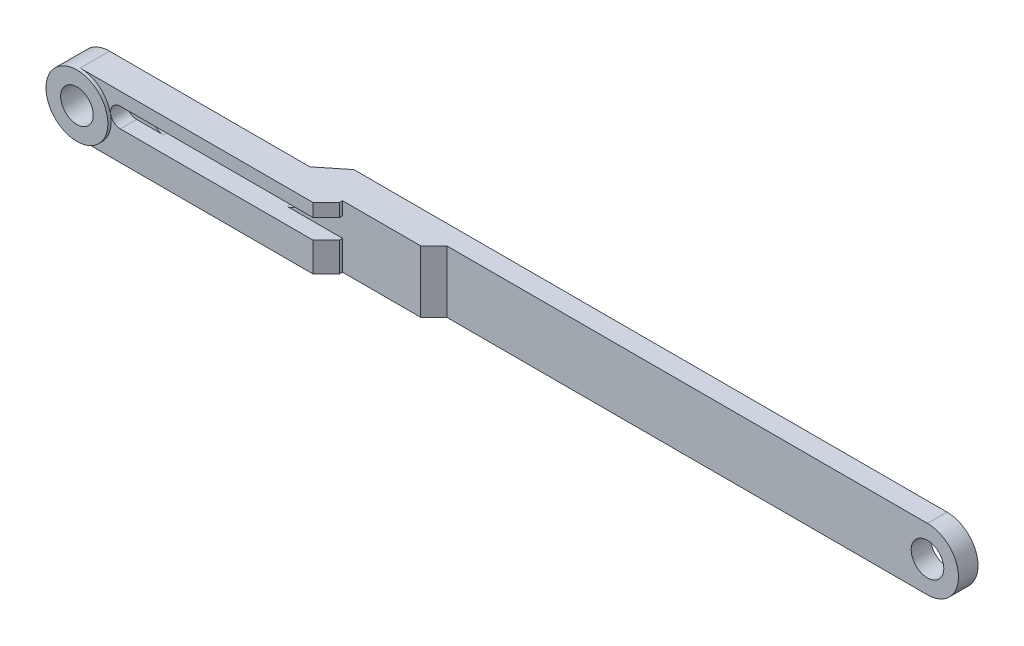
ISO-10303-21;
HEADER;
FILE_DESCRIPTION(('STEP AP214'),'2;1');
FILE_NAME('part.step','',(''),(''),'','','');
FILE_SCHEMA(('AUTOMOTIVE_DESIGN { 1 0 10303 214 1 1 1 1 }'));
ENDSEC;
DATA;
#1=APPLICATION_CONTEXT('core data for automotive mechanical design processes');
#2=APPLICATION_PROTOCOL_DEFINITION('international standard','automotive_design',2000,#1);
#3=PRODUCT_CONTEXT('',#1,'mechanical');
#4=PRODUCT('Part','Part','',(#3));
#5=PRODUCT_RELATED_PRODUCT_CATEGORY('part','',(#4));
#6=PRODUCT_DEFINITION_FORMATION('','',#4);
#7=PRODUCT_DEFINITION_CONTEXT('part definition',#1,'design');
#8=PRODUCT_DEFINITION('design','',#6,#7);
#9=PRODUCT_DEFINITION_SHAPE('','',#8);
#10=(LENGTH_UNIT() NAMED_UNIT(*) SI_UNIT(.MILLI.,.METRE.));
#11=(NAMED_UNIT(*) PLANE_ANGLE_UNIT() SI_UNIT($,.RADIAN.));
#12=(NAMED_UNIT(*) SI_UNIT($,.STERADIAN.) SOLID_ANGLE_UNIT());
#13=UNCERTAINTY_MEASURE_WITH_UNIT(LENGTH_MEASURE(1.E-05),#10,'distance_accuracy_value','');
#14=(GEOMETRIC_REPRESENTATION_CONTEXT(3) GLOBAL_UNCERTAINTY_ASSIGNED_CONTEXT((#13)) GLOBAL_UNIT_ASSIGNED_CONTEXT((#10,
#11,#12)) REPRESENTATION_CONTEXT('',''));
#15=CARTESIAN_POINT('',(0.,0.,0.));
#16=DIRECTION('',(0.,0.,1.));
#17=DIRECTION('',(1.,0.,0.));
#18=AXIS2_PLACEMENT_3D('',#15,#16,#17);
#19=CARTESIAN_POINT('',(42.5,9.49999999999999,4.5));
#20=DIRECTION('',(1.,0.,0.));
#21=DIRECTION('',(0.,0.,-1.));
#22=AXIS2_PLACEMENT_3D('',#19,#20,#21);
#23=PLANE('',#22);
#24=DIRECTION('',(0.,0.,1.));
#25=VECTOR('',#24,1.);
#26=CARTESIAN_POINT('',(42.5,4.49999999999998,2.));
#27=LINE('',#26,#25);
#28=CARTESIAN_POINT('',(42.5,4.49999999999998,2.49999999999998));
#29=VERTEX_POINT('',#28);
#30=CARTESIAN_POINT('',(42.5,4.49999999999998,2.00000000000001));
#31=VERTEX_POINT('',#30);
#32=EDGE_CURVE('E272',#29,#31,#27,.F.);
#33=ORIENTED_EDGE('',*,*,#32,.F.);
#34=DIRECTION('',(0.,-1.,0.));
#35=VECTOR('',#34,1.);
#36=CARTESIAN_POINT('',(42.5,9.49999999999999,2.49999999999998));
#37=LINE('',#36,#35);
#38=CARTESIAN_POINT('',(42.5,0.,2.49999999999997));
#39=VERTEX_POINT('',#38);
#40=EDGE_CURVE('E363',#29,#39,#37,.T.);
#41=ORIENTED_EDGE('',*,*,#40,.T.);
#42=DIRECTION('',(0.,0.,-1.));
#43=VECTOR('',#42,1.);
#44=CARTESIAN_POINT('',(42.5,0.,4.5));
#45=LINE('',#44,#43);
#46=CARTESIAN_POINT('',(42.5,0.,2.));
#47=VERTEX_POINT('',#46);
#48=EDGE_CURVE('E454',#39,#47,#45,.T.);
#49=ORIENTED_EDGE('',*,*,#48,.T.);
#50=DIRECTION('',(0.,-1.,0.));
#51=VECTOR('',#50,1.);
#52=CARTESIAN_POINT('',(42.5,9.49999999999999,2.));
#53=LINE('',#52,#51);
#54=EDGE_CURVE('E227',#31,#47,#53,.T.);
#55=ORIENTED_EDGE('',*,*,#54,.F.);
#56=EDGE_LOOP('',(#33,#41,#49,#55));
#57=FACE_BOUND('',#56,.T.);
#58=ADVANCED_FACE('F51',(#57),#23,.T.);
#59=CARTESIAN_POINT('',(4.75,4.75,4.5));
#60=DIRECTION('',(0.,0.,1.));
#61=DIRECTION('',(1.,0.,0.));
#62=AXIS2_PLACEMENT_3D('',#59,#60,#61);
#63=PLANE('',#62);
#64=DIRECTION('',(1.,0.,0.));
#65=VECTOR('',#64,1.);
#66=CARTESIAN_POINT('',(15.,7.49999999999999,4.5));
#67=LINE('',#66,#65);
#68=CARTESIAN_POINT('',(10.9053629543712,7.49999999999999,4.5));
#69=VERTEX_POINT('',#68);
#70=CARTESIAN_POINT('',(40.5,7.49999999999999,4.5));
#71=VERTEX_POINT('',#70);
#72=EDGE_CURVE('E413',#69,#71,#67,.T.);
#73=ORIENTED_EDGE('',*,*,#72,.T.);
#74=DIRECTION('',(0.,1.,0.));
#75=VECTOR('',#74,1.);
#76=CARTESIAN_POINT('',(40.5,4.75,4.5));
#77=LINE('',#76,#75);
#78=CARTESIAN_POINT('',(40.5,9.49999999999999,4.5));
#79=VERTEX_POINT('',#78);
#80=EDGE_CURVE('E374',#71,#79,#77,.T.);
#81=ORIENTED_EDGE('',*,*,#80,.T.);
#82=DIRECTION('',(1.,0.,0.));
#83=VECTOR('',#82,1.);
#84=CARTESIAN_POINT('',(42.5,9.49999999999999,4.5));
#85=LINE('',#84,#83);
#86=CARTESIAN_POINT('',(4.75,9.5,4.5));
#87=VERTEX_POINT('',#86);
#88=EDGE_CURVE('E441',#87,#79,#85,.T.);
#89=ORIENTED_EDGE('',*,*,#88,.F.);
#90=CARTESIAN_POINT('',(4.75,4.75,4.5));
#91=DIRECTION('',(0.,0.,1.));
#92=DIRECTION('',(1.,0.,0.));
#93=AXIS2_PLACEMENT_3D('',#90,#91,#92);
#94=CIRCLE('',#93,4.75);
#95=CARTESIAN_POINT('',(4.75,0.,4.5));
#96=VERTEX_POINT('',#95);
#97=EDGE_CURVE('E439',#96,#87,#94,.T.);
#98=ORIENTED_EDGE('',*,*,#97,.F.);
#99=DIRECTION('',(-1.,0.,0.));
#100=VECTOR('',#99,1.);
#101=CARTESIAN_POINT('',(4.75,0.,4.5));
#102=LINE('',#101,#100);
#103=CARTESIAN_POINT('',(40.5,0.,4.5));
#104=VERTEX_POINT('',#103);
#105=EDGE_CURVE('E445',#104,#96,#102,.T.);
#106=ORIENTED_EDGE('',*,*,#105,.F.);
#107=DIRECTION('',(0.,1.,0.));
#108=VECTOR('',#107,1.);
#109=CARTESIAN_POINT('',(40.5,4.75,4.5));
#110=LINE('',#109,#108);
#111=CARTESIAN_POINT('',(40.5,4.49999999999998,4.5));
#112=VERTEX_POINT('',#111);
#113=EDGE_CURVE('E468',#104,#112,#110,.T.);
#114=ORIENTED_EDGE('',*,*,#113,.T.);
#115=DIRECTION('',(-1.,0.,0.));
#116=VECTOR('',#115,1.);
#117=CARTESIAN_POINT('',(15.,4.49999999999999,4.5));
#118=LINE('',#117,#116);
#119=CARTESIAN_POINT('',(10.9053629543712,4.49999999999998,4.5));
#120=VERTEX_POINT('',#119);
#121=EDGE_CURVE('E417',#112,#120,#118,.T.);
#122=ORIENTED_EDGE('',*,*,#121,.T.);
#123=CARTESIAN_POINT('',(10.9053629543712,5.99999999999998,4.5));
#124=DIRECTION('',(0.,0.,1.));
#125=DIRECTION('',(1.,0.,0.));
#126=AXIS2_PLACEMENT_3D('',#123,#124,#125);
#127=CIRCLE('',#126,1.5);
#128=EDGE_CURVE('E265',#120,#69,#127,.F.);
#129=ORIENTED_EDGE('',*,*,#128,.T.);
#130=EDGE_LOOP('',(#73,#81,#89,#98,#106,#114,#122,#129));
#131=FACE_BOUND('',#130,.T.);
#132=ADVANCED_FACE('F311',(#131),#63,.T.);
#133=CARTESIAN_POINT('',(15.,5.99999999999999,4.5));
#134=DIRECTION('',(0.,0.,-1.));
#135=DIRECTION('',(-1.,0.,0.));
#136=AXIS2_PLACEMENT_3D('',#133,#134,#135);
#137=CYLINDRICAL_SURFACE('',#136,1.5);
#138=CARTESIAN_POINT('',(15.,5.99999999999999,2.));
#139=DIRECTION('',(0.,0.,1.));
#140=DIRECTION('',(1.,0.,0.));
#141=AXIS2_PLACEMENT_3D('',#138,#139,#140);
#142=CIRCLE('',#141,1.5);
#143=CARTESIAN_POINT('',(15.,4.49999999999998,2.00000000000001));
#144=VERTEX_POINT('',#143);
#145=CARTESIAN_POINT('',(15.,7.49999999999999,2.));
#146=VERTEX_POINT('',#145);
#147=EDGE_CURVE('E240',#144,#146,#142,.F.);
#148=ORIENTED_EDGE('',*,*,#147,.F.);
#149=DIRECTION('',(0.,0.,-1.));
#150=VECTOR('',#149,1.);
#151=CARTESIAN_POINT('',(15.,4.49999999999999,4.5));
#152=LINE('',#151,#150);
#153=CARTESIAN_POINT('',(15.,4.49999999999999,0.));
#154=VERTEX_POINT('',#153);
#155=EDGE_CURVE('E398',#144,#154,#152,.T.);
#156=ORIENTED_EDGE('',*,*,#155,.T.);
#157=CARTESIAN_POINT('',(15.,5.99999999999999,0.));
#158=DIRECTION('',(0.,0.,-1.));
#159=DIRECTION('',(-1.,0.,0.));
#160=AXIS2_PLACEMENT_3D('',#157,#158,#159);
#161=CIRCLE('',#160,1.5);
#162=CARTESIAN_POINT('',(15.,7.49999999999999,0.));
#163=VERTEX_POINT('',#162);
#164=EDGE_CURVE('E412',#154,#163,#161,.T.);
#165=ORIENTED_EDGE('',*,*,#164,.T.);
#166=DIRECTION('',(0.,0.,-1.));
#167=VECTOR('',#166,1.);
#168=CARTESIAN_POINT('',(15.,7.49999999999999,4.5));
#169=LINE('',#168,#167);
#170=EDGE_CURVE('E437',#146,#163,#169,.T.);
#171=ORIENTED_EDGE('',*,*,#170,.F.);
#172=EDGE_LOOP('',(#148,#156,#165,#171));
#173=FACE_BOUND('',#172,.T.);
#174=ADVANCED_FACE('F304',(#173),#137,.F.);
#175=CARTESIAN_POINT('',(34.,5.99999999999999,4.5));
#176=DIRECTION('',(0.,0.,-1.));
#177=DIRECTION('',(-1.,0.,0.));
#178=AXIS2_PLACEMENT_3D('',#175,#176,#177);
#179=CYLINDRICAL_SURFACE('',#178,1.5);
#180=CARTESIAN_POINT('',(34.,5.99999999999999,2.));
#181=DIRECTION('',(0.,0.,1.));
#182=DIRECTION('',(1.,0.,0.));
#183=AXIS2_PLACEMENT_3D('',#180,#181,#182);
#184=CIRCLE('',#183,1.5);
#185=CARTESIAN_POINT('',(34.,7.49999999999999,2.));
#186=VERTEX_POINT('',#185);
#187=CARTESIAN_POINT('',(34.,4.49999999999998,2.));
#188=VERTEX_POINT('',#187);
#189=EDGE_CURVE('E206',#186,#188,#184,.F.);
#190=ORIENTED_EDGE('',*,*,#189,.F.);
#191=DIRECTION('',(0.,0.,-1.));
#192=VECTOR('',#191,1.);
#193=CARTESIAN_POINT('',(34.,7.49999999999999,4.5));
#194=LINE('',#193,#192);
#195=CARTESIAN_POINT('',(34.,7.49999999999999,0.));
#196=VERTEX_POINT('',#195);
#197=EDGE_CURVE('E213',#186,#196,#194,.T.);
#198=ORIENTED_EDGE('',*,*,#197,.T.);
#199=CARTESIAN_POINT('',(34.,5.99999999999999,0.));
#200=DIRECTION('',(0.,0.,-1.));
#201=DIRECTION('',(-1.,0.,0.));
#202=AXIS2_PLACEMENT_3D('',#199,#200,#201);
#203=CIRCLE('',#202,1.5);
#204=CARTESIAN_POINT('',(34.,4.49999999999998,0.));
#205=VERTEX_POINT('',#204);
#206=EDGE_CURVE('E424',#196,#205,#203,.T.);
#207=ORIENTED_EDGE('',*,*,#206,.T.);
#208=DIRECTION('',(0.,0.,-1.));
#209=VECTOR('',#208,1.);
#210=CARTESIAN_POINT('',(34.,4.49999999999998,4.5));
#211=LINE('',#210,#209);
#212=EDGE_CURVE('E432',#188,#205,#211,.T.);
#213=ORIENTED_EDGE('',*,*,#212,.F.);
#214=EDGE_LOOP('',(#190,#198,#207,#213));
#215=FACE_BOUND('',#214,.T.);
#216=ADVANCED_FACE('F300',(#215),#179,.F.);
#217=CARTESIAN_POINT('',(130.25,4.75,0.));
#218=DIRECTION('',(0.,0.,-1.));
#219=DIRECTION('',(-1.,0.,0.));
#220=AXIS2_PLACEMENT_3D('',#217,#218,#219);
#221=PLANE('',#220);
#222=CARTESIAN_POINT('',(130.25,4.75,0.));
#223=DIRECTION('',(0.,0.,-1.));
#224=DIRECTION('',(-1.,0.,0.));
#225=AXIS2_PLACEMENT_3D('',#222,#223,#224);
#226=CIRCLE('',#225,2.5);
#227=CARTESIAN_POINT('',(127.75,4.75,0.));
#228=VERTEX_POINT('',#227);
#229=EDGE_CURVE('E231',#228,#228,#226,.T.);
#230=ORIENTED_EDGE('',*,*,#229,.T.);
#231=EDGE_LOOP('',(#230));
#232=FACE_BOUND('',#231,.T.);
#233=DIRECTION('',(0.,1.,0.));
#234=VECTOR('',#233,1.);
#235=CARTESIAN_POINT('',(56.5,0.,0.));
#236=LINE('',#235,#234);
#237=CARTESIAN_POINT('',(56.5,0.,0.));
#238=VERTEX_POINT('',#237);
#239=CARTESIAN_POINT('',(56.5,9.49999999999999,0.));
#240=VERTEX_POINT('',#239);
#241=EDGE_CURVE('E237',#238,#240,#236,.T.);
#242=ORIENTED_EDGE('',*,*,#241,.F.);
#243=DIRECTION('',(-1.,0.,0.));
#244=VECTOR('',#243,1.);
#245=CARTESIAN_POINT('',(42.5,0.,0.));
#246=LINE('',#245,#244);
#247=CARTESIAN_POINT('',(130.25,0.,0.));
#248=VERTEX_POINT('',#247);
#249=EDGE_CURVE('E400',#248,#238,#246,.T.);
#250=ORIENTED_EDGE('',*,*,#249,.F.);
#251=CARTESIAN_POINT('',(130.25,4.75,0.));
#252=DIRECTION('',(0.,0.,-1.));
#253=DIRECTION('',(-1.,0.,0.));
#254=AXIS2_PLACEMENT_3D('',#251,#252,#253);
#255=CIRCLE('',#254,4.75);
#256=CARTESIAN_POINT('',(130.25,9.5,0.));
#257=VERTEX_POINT('',#256);
#258=EDGE_CURVE('E258',#257,#248,#255,.T.);
#259=ORIENTED_EDGE('',*,*,#258,.F.);
#260=DIRECTION('',(1.,0.,0.));
#261=VECTOR('',#260,1.);
#262=CARTESIAN_POINT('',(42.5,9.49999999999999,0.));
#263=LINE('',#262,#261);
#264=EDGE_CURVE('E244',#240,#257,#263,.T.);
#265=ORIENTED_EDGE('',*,*,#264,.F.);
#266=EDGE_LOOP('',(#242,#250,#259,#265));
#267=FACE_BOUND('',#266,.T.);
#268=ADVANCED_FACE('F303',(#232,#267),#221,.F.);
#269=CARTESIAN_POINT('',(0.,0.,0.));
#270=DIRECTION('',(0.,0.,1.));
#271=DIRECTION('',(1.,0.,0.));
#272=AXIS2_PLACEMENT_3D('',#269,#270,#271);
#273=PLANE('',#272);
#274=DIRECTION('',(1.,0.,0.));
#275=VECTOR('',#274,1.);
#276=CARTESIAN_POINT('',(15.,7.49999999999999,0.));
#277=LINE('',#276,#275);
#278=EDGE_CURVE('E421',#163,#196,#277,.T.);
#279=ORIENTED_EDGE('',*,*,#278,.F.);
#280=ORIENTED_EDGE('',*,*,#164,.F.);
#281=DIRECTION('',(-1.,0.,0.));
#282=VECTOR('',#281,1.);
#283=CARTESIAN_POINT('',(15.,4.49999999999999,0.));
#284=LINE('',#283,#282);
#285=EDGE_CURVE('E418',#205,#154,#284,.T.);
#286=ORIENTED_EDGE('',*,*,#285,.F.);
#287=ORIENTED_EDGE('',*,*,#206,.F.);
#288=EDGE_LOOP('',(#279,#280,#286,#287));
#289=FACE_BOUND('',#288,.T.);
#290=CARTESIAN_POINT('',(4.75,4.75,0.));
#291=DIRECTION('',(0.,0.,1.));
#292=DIRECTION('',(1.,0.,0.));
#293=AXIS2_PLACEMENT_3D('',#290,#291,#292);
#294=CIRCLE('',#293,2.5);
#295=CARTESIAN_POINT('',(7.25,4.75,0.));
#296=VERTEX_POINT('',#295);
#297=EDGE_CURVE('E453',#296,#296,#294,.T.);
#298=ORIENTED_EDGE('',*,*,#297,.T.);
#299=EDGE_LOOP('',(#298));
#300=FACE_BOUND('',#299,.T.);
#301=DIRECTION('',(-0.593199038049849,0.805055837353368,0.));
#302=VECTOR('',#301,1.);
#303=CARTESIAN_POINT('',(35.5,9.5,0.));
#304=LINE('',#303,#302);
#305=CARTESIAN_POINT('',(42.5,0.,0.));
#306=VERTEX_POINT('',#305);
#307=CARTESIAN_POINT('',(35.5,9.5,0.));
#308=VERTEX_POINT('',#307);
#309=EDGE_CURVE('E251',#306,#308,#304,.T.);
#310=ORIENTED_EDGE('',*,*,#309,.F.);
#311=DIRECTION('',(-1.,0.,0.));
#312=VECTOR('',#311,1.);
#313=CARTESIAN_POINT('',(4.75,0.,0.));
#314=LINE('',#313,#312);
#315=CARTESIAN_POINT('',(4.75,0.,0.));
#316=VERTEX_POINT('',#315);
#317=EDGE_CURVE('E397',#306,#316,#314,.T.);
#318=ORIENTED_EDGE('',*,*,#317,.T.);
#319=CARTESIAN_POINT('',(4.75,4.75,0.));
#320=DIRECTION('',(0.,0.,1.));
#321=DIRECTION('',(1.,0.,0.));
#322=AXIS2_PLACEMENT_3D('',#319,#320,#321);
#323=CIRCLE('',#322,4.75);
#324=CARTESIAN_POINT('',(4.75,9.5,0.));
#325=VERTEX_POINT('',#324);
#326=EDGE_CURVE('E394',#325,#316,#323,.T.);
#327=ORIENTED_EDGE('',*,*,#326,.F.);
#328=DIRECTION('',(1.,0.,0.));
#329=VECTOR('',#328,1.);
#330=CARTESIAN_POINT('',(42.5,9.49999999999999,0.));
#331=LINE('',#330,#329);
#332=EDGE_CURVE('E390',#325,#308,#331,.T.);
#333=ORIENTED_EDGE('',*,*,#332,.T.);
#334=EDGE_LOOP('',(#310,#318,#327,#333));
#335=FACE_BOUND('',#334,.T.);
#336=ADVANCED_FACE('F329',(#289,#300,#335),#273,.F.);
#337=CARTESIAN_POINT('',(4.75,4.75,5.));
#338=DIRECTION('',(0.,0.,-1.));
#339=DIRECTION('',(-1.,0.,0.));
#340=AXIS2_PLACEMENT_3D('',#337,#338,#339);
#341=CYLINDRICAL_SURFACE('',#340,4.75);
#342=CARTESIAN_POINT('',(4.75,4.75,5.));
#343=DIRECTION('',(0.,0.,1.));
#344=DIRECTION('',(1.,0.,0.));
#345=AXIS2_PLACEMENT_3D('',#342,#343,#344);
#346=CIRCLE('',#345,4.75);
#347=CARTESIAN_POINT('',(9.5,4.75,5.));
#348=VERTEX_POINT('',#347);
#349=EDGE_CURVE('E269',#348,#348,#346,.T.);
#350=ORIENTED_EDGE('',*,*,#349,.F.);
#351=EDGE_LOOP('',(#350));
#352=FACE_BOUND('',#351,.T.);
#353=DIRECTION('',(0.,0.,-1.));
#354=VECTOR('',#353,1.);
#355=CARTESIAN_POINT('',(4.75,0.,4.5));
#356=LINE('',#355,#354);
#357=EDGE_CURVE('E450',#96,#316,#356,.T.);
#358=ORIENTED_EDGE('',*,*,#357,.F.);
#359=ORIENTED_EDGE('',*,*,#97,.T.);
#360=DIRECTION('',(0.,0.,-1.));
#361=VECTOR('',#360,1.);
#362=CARTESIAN_POINT('',(4.75,9.5,4.5));
#363=LINE('',#362,#361);
#364=EDGE_CURVE('E446',#87,#325,#363,.T.);
#365=ORIENTED_EDGE('',*,*,#364,.T.);
#366=ORIENTED_EDGE('',*,*,#326,.T.);
#367=EDGE_LOOP('',(#358,#359,#365,#366));
#368=FACE_BOUND('',#367,.T.);
#369=ADVANCED_FACE('F332',(#352,#368),#341,.T.);
#370=CARTESIAN_POINT('',(4.75,4.75,5.));
#371=DIRECTION('',(0.,0.,-1.));
#372=DIRECTION('',(-1.,0.,0.));
#373=AXIS2_PLACEMENT_3D('',#370,#371,#372);
#374=CYLINDRICAL_SURFACE('',#373,2.5);
#375=CARTESIAN_POINT('',(4.75,4.75,5.));
#376=DIRECTION('',(0.,0.,1.));
#377=DIRECTION('',(1.,0.,0.));
#378=AXIS2_PLACEMENT_3D('',#375,#376,#377);
#379=CIRCLE('',#378,2.5);
#380=CARTESIAN_POINT('',(7.25,4.75,5.));
#381=VERTEX_POINT('',#380);
#382=EDGE_CURVE('E458',#381,#381,#379,.T.);
#383=ORIENTED_EDGE('',*,*,#382,.T.);
#384=EDGE_LOOP('',(#383));
#385=FACE_BOUND('',#384,.T.);
#386=ORIENTED_EDGE('',*,*,#297,.F.);
#387=EDGE_LOOP('',(#386));
#388=FACE_BOUND('',#387,.T.);
#389=ADVANCED_FACE('F327',(#385,#388),#374,.F.);
#390=CARTESIAN_POINT('',(0.,0.,5.));
#391=DIRECTION('',(0.,0.,1.));
#392=DIRECTION('',(1.,0.,0.));
#393=AXIS2_PLACEMENT_3D('',#390,#391,#392);
#394=PLANE('',#393);
#395=ORIENTED_EDGE('',*,*,#382,.F.);
#396=EDGE_LOOP('',(#395));
#397=FACE_BOUND('',#396,.T.);
#398=ORIENTED_EDGE('',*,*,#349,.T.);
#399=EDGE_LOOP('',(#398));
#400=FACE_BOUND('',#399,.T.);
#401=ADVANCED_FACE('F319',(#397,#400),#394,.T.);
#402=CARTESIAN_POINT('',(4.75,0.,4.5));
#403=DIRECTION('',(0.,-1.,0.));
#404=DIRECTION('',(1.,0.,0.));
#405=AXIS2_PLACEMENT_3D('',#402,#403,#404);
#406=PLANE('',#405);
#407=ORIENTED_EDGE('',*,*,#317,.F.);
#408=DIRECTION('',(0.778944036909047,0.,-0.627093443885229));
#409=VECTOR('',#408,1.);
#410=CARTESIAN_POINT('',(17.3969254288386,0.,20.2093767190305));
#411=LINE('',#410,#409);
#412=CARTESIAN_POINT('',(46.2264495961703,0.,-3.));
#413=VERTEX_POINT('',#412);
#414=EDGE_CURVE('E13',#306,#413,#411,.T.);
#415=ORIENTED_EDGE('',*,*,#414,.T.);
#416=DIRECTION('',(-1.,0.,0.));
#417=VECTOR('',#416,1.);
#418=CARTESIAN_POINT('',(42.5,0.,-3.));
#419=LINE('',#418,#417);
#420=CARTESIAN_POINT('',(130.25,0.,-3.));
#421=VERTEX_POINT('',#420);
#422=EDGE_CURVE('E253',#421,#413,#419,.T.);
#423=ORIENTED_EDGE('',*,*,#422,.F.);
#424=DIRECTION('',(0.,0.,1.));
#425=VECTOR('',#424,1.);
#426=CARTESIAN_POINT('',(130.25,0.,-3.));
#427=LINE('',#426,#425);
#428=EDGE_CURVE('E255',#421,#248,#427,.T.);
#429=ORIENTED_EDGE('',*,*,#428,.T.);
#430=ORIENTED_EDGE('',*,*,#249,.T.);
#431=DIRECTION('',(-0.707106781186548,0.,0.707106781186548));
#432=VECTOR('',#431,1.);
#433=CARTESIAN_POINT('',(28.375,0.,28.125));
#434=LINE('',#433,#432);
#435=CARTESIAN_POINT('',(54.5,0.,2.));
#436=VERTEX_POINT('',#435);
#437=EDGE_CURVE('E477',#238,#436,#434,.T.);
#438=ORIENTED_EDGE('',*,*,#437,.T.);
#439=DIRECTION('',(1.,0.,0.));
#440=VECTOR('',#439,1.);
#441=CARTESIAN_POINT('',(42.5,0.,2.));
#442=LINE('',#441,#440);
#443=EDGE_CURVE('E226',#47,#436,#442,.T.);
#444=ORIENTED_EDGE('',*,*,#443,.F.);
#445=ORIENTED_EDGE('',*,*,#48,.F.);
#446=DIRECTION('',(0.707106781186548,0.,-0.707106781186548));
#447=VECTOR('',#446,1.);
#448=CARTESIAN_POINT('',(22.625,0.,22.375));
#449=LINE('',#448,#447);
#450=EDGE_CURVE('E369',#39,#104,#449,.F.);
#451=ORIENTED_EDGE('',*,*,#450,.T.);
#452=ORIENTED_EDGE('',*,*,#105,.T.);
#453=ORIENTED_EDGE('',*,*,#357,.T.);
#454=EDGE_LOOP('',(#407,#415,#423,#429,#430,#438,#444,#445,#451,#452,#453));
#455=FACE_BOUND('',#454,.T.);
#456=ADVANCED_FACE('F316',(#455),#406,.T.);
#457=DIRECTION('',(0.,0.,-1.));
#458=VECTOR('',#457,1.);
#459=CARTESIAN_POINT('',(42.5,9.49999999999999,4.5));
#460=LINE('',#459,#458);
#461=CARTESIAN_POINT('',(42.5,9.49999999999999,2.49999999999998));
#462=VERTEX_POINT('',#461);
#463=CARTESIAN_POINT('',(42.5,9.49999999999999,2.));
#464=VERTEX_POINT('',#463);
#465=EDGE_CURVE('E456',#462,#464,#460,.T.);
#466=ORIENTED_EDGE('',*,*,#465,.F.);
#467=DIRECTION('',(0.,-1.,0.));
#468=VECTOR('',#467,1.);
#469=CARTESIAN_POINT('',(42.5,9.49999999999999,2.49999999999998));
#470=LINE('',#469,#468);
#471=CARTESIAN_POINT('',(42.5,7.49999999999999,2.49999999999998));
#472=VERTEX_POINT('',#471);
#473=EDGE_CURVE('E204',#462,#472,#470,.T.);
#474=ORIENTED_EDGE('',*,*,#473,.T.);
#475=DIRECTION('',(0.,0.,-1.));
#476=VECTOR('',#475,1.);
#477=CARTESIAN_POINT('',(42.5,7.49999999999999,4.));
#478=LINE('',#477,#476);
#479=CARTESIAN_POINT('',(42.5,7.49999999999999,1.99999999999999));
#480=VERTEX_POINT('',#479);
#481=EDGE_CURVE('E197',#472,#480,#478,.T.);
#482=ORIENTED_EDGE('',*,*,#481,.T.);
#483=EDGE_CURVE('E202',#464,#480,#53,.T.);
#484=ORIENTED_EDGE('',*,*,#483,.F.);
#485=EDGE_LOOP('',(#466,#474,#482,#484));
#486=FACE_BOUND('',#485,.T.);
#487=ADVANCED_FACE('F200',(#486),#23,.T.);
#488=CARTESIAN_POINT('',(42.5,9.49999999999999,4.5));
#489=DIRECTION('',(0.,1.,0.));
#490=DIRECTION('',(-1.,0.,0.));
#491=AXIS2_PLACEMENT_3D('',#488,#489,#490);
#492=PLANE('',#491);
#493=DIRECTION('',(1.,0.,0.));
#494=VECTOR('',#493,1.);
#495=CARTESIAN_POINT('',(42.5,9.49999999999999,-3.));
#496=LINE('',#495,#494);
#497=CARTESIAN_POINT('',(39.2264495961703,9.49999999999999,-3.));
#498=VERTEX_POINT('',#497);
#499=CARTESIAN_POINT('',(130.25,9.5,-3.));
#500=VERTEX_POINT('',#499);
#501=EDGE_CURVE('E247',#498,#500,#496,.T.);
#502=ORIENTED_EDGE('',*,*,#501,.F.);
#503=DIRECTION('',(-0.778944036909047,0.,0.627093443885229));
#504=VECTOR('',#503,1.);
#505=CARTESIAN_POINT('',(37.5491585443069,9.49999999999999,-1.64968704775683));
#506=LINE('',#505,#504);
#507=EDGE_CURVE('E59',#498,#308,#506,.T.);
#508=ORIENTED_EDGE('',*,*,#507,.T.);
#509=ORIENTED_EDGE('',*,*,#332,.F.);
#510=ORIENTED_EDGE('',*,*,#364,.F.);
#511=ORIENTED_EDGE('',*,*,#88,.T.);
#512=DIRECTION('',(-0.707106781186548,0.,0.707106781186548));
#513=VECTOR('',#512,1.);
#514=CARTESIAN_POINT('',(41.5,9.49999999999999,3.49999999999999));
#515=LINE('',#514,#513);
#516=EDGE_CURVE('E370',#79,#462,#515,.F.);
#517=ORIENTED_EDGE('',*,*,#516,.T.);
#518=ORIENTED_EDGE('',*,*,#465,.T.);
#519=DIRECTION('',(-1.,0.,0.));
#520=VECTOR('',#519,1.);
#521=CARTESIAN_POINT('',(56.5,9.49999999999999,2.));
#522=LINE('',#521,#520);
#523=CARTESIAN_POINT('',(54.5,9.49999999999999,2.));
#524=VERTEX_POINT('',#523);
#525=EDGE_CURVE('E224',#524,#464,#522,.T.);
#526=ORIENTED_EDGE('',*,*,#525,.F.);
#527=DIRECTION('',(0.707106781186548,0.,-0.707106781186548));
#528=VECTOR('',#527,1.);
#529=CARTESIAN_POINT('',(47.25,9.49999999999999,9.25));
#530=LINE('',#529,#528);
#531=EDGE_CURVE('E480',#524,#240,#530,.T.);
#532=ORIENTED_EDGE('',*,*,#531,.T.);
#533=ORIENTED_EDGE('',*,*,#264,.T.);
#534=DIRECTION('',(0.,0.,1.));
#535=VECTOR('',#534,1.);
#536=CARTESIAN_POINT('',(130.25,9.5,-3.));
#537=LINE('',#536,#535);
#538=EDGE_CURVE('E409',#500,#257,#537,.T.);
#539=ORIENTED_EDGE('',*,*,#538,.F.);
#540=EDGE_LOOP('',(#502,#508,#509,#510,#511,#517,#518,#526,#532,#533,#539));
#541=FACE_BOUND('',#540,.T.);
#542=ADVANCED_FACE('F297',(#541),#492,.T.);
#543=CARTESIAN_POINT('',(15.,4.49999999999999,4.5));
#544=DIRECTION('',(0.,-1.,0.));
#545=DIRECTION('',(1.,0.,0.));
#546=AXIS2_PLACEMENT_3D('',#543,#544,#545);
#547=PLANE('',#546);
#548=ORIENTED_EDGE('',*,*,#121,.F.);
#549=DIRECTION('',(-0.707106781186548,0.,0.707106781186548));
#550=VECTOR('',#549,1.);
#551=CARTESIAN_POINT('',(42.5,4.49999999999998,2.49999999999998));
#552=LINE('',#551,#550);
#553=EDGE_CURVE('E368',#112,#29,#552,.F.);
#554=ORIENTED_EDGE('',*,*,#553,.T.);
#555=ORIENTED_EDGE('',*,*,#32,.T.);
#556=DIRECTION('',(-1.,0.,0.));
#557=VECTOR('',#556,1.);
#558=CARTESIAN_POINT('',(42.5,4.49999999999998,2.00000000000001));
#559=LINE('',#558,#557);
#560=EDGE_CURVE('E488',#31,#188,#559,.T.);
#561=ORIENTED_EDGE('',*,*,#560,.T.);
#562=ORIENTED_EDGE('',*,*,#212,.T.);
#563=ORIENTED_EDGE('',*,*,#285,.T.);
#564=ORIENTED_EDGE('',*,*,#155,.F.);
#565=CARTESIAN_POINT('',(10.9053629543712,4.49999999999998,2.00000000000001));
#566=VERTEX_POINT('',#565);
#567=EDGE_CURVE('E489',#144,#566,#559,.T.);
#568=ORIENTED_EDGE('',*,*,#567,.T.);
#569=CARTESIAN_POINT('',(10.9053629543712,4.49999999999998,4.5));
#570=DIRECTION('',(0.,0.,-1.));
#571=VECTOR('',#570,1.);
#572=LINE('',#569,#571);
#573=EDGE_CURVE('E280',#120,#566,#572,.T.);
#574=ORIENTED_EDGE('',*,*,#573,.F.);
#575=EDGE_LOOP('',(#548,#554,#555,#561,#562,#563,#564,#568,#574));
#576=FACE_BOUND('',#575,.T.);
#577=ADVANCED_FACE('F287',(#576),#547,.F.);
#578=CARTESIAN_POINT('',(15.,7.49999999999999,4.5));
#579=DIRECTION('',(0.,1.,0.));
#580=DIRECTION('',(-1.,0.,0.));
#581=AXIS2_PLACEMENT_3D('',#578,#579,#580);
#582=PLANE('',#581);
#583=ORIENTED_EDGE('',*,*,#481,.F.);
#584=DIRECTION('',(0.707106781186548,0.,-0.707106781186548));
#585=VECTOR('',#584,1.);
#586=CARTESIAN_POINT('',(42.5,7.49999999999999,2.49999999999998));
#587=LINE('',#586,#585);
#588=EDGE_CURVE('E470',#472,#71,#587,.F.);
#589=ORIENTED_EDGE('',*,*,#588,.T.);
#590=ORIENTED_EDGE('',*,*,#72,.F.);
#591=DIRECTION('',(0.,0.,-1.));
#592=VECTOR('',#591,1.);
#593=CARTESIAN_POINT('',(10.9053629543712,7.49999999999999,4.));
#594=LINE('',#593,#592);
#595=CARTESIAN_POINT('',(10.9053629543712,7.49999999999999,1.99999999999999));
#596=VERTEX_POINT('',#595);
#597=EDGE_CURVE('E207',#69,#596,#594,.T.);
#598=ORIENTED_EDGE('',*,*,#597,.T.);
#599=DIRECTION('',(-1.,0.,0.));
#600=VECTOR('',#599,1.);
#601=CARTESIAN_POINT('',(42.5,7.49999999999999,2.));
#602=LINE('',#601,#600);
#603=EDGE_CURVE('E217',#146,#596,#602,.T.);
#604=ORIENTED_EDGE('',*,*,#603,.F.);
#605=ORIENTED_EDGE('',*,*,#170,.T.);
#606=ORIENTED_EDGE('',*,*,#278,.T.);
#607=ORIENTED_EDGE('',*,*,#197,.F.);
#608=EDGE_CURVE('E210',#480,#186,#602,.T.);
#609=ORIENTED_EDGE('',*,*,#608,.F.);
#610=EDGE_LOOP('',(#583,#589,#590,#598,#604,#605,#606,#607,#609));
#611=FACE_BOUND('',#610,.T.);
#612=ADVANCED_FACE('F211',(#611),#582,.F.);
#613=CARTESIAN_POINT('',(130.25,4.75,-3.));
#614=DIRECTION('',(0.,0.,-1.));
#615=DIRECTION('',(-1.,0.,0.));
#616=AXIS2_PLACEMENT_3D('',#613,#614,#615);
#617=PLANE('',#616);
#618=ORIENTED_EDGE('',*,*,#422,.T.);
#619=DIRECTION('',(-0.59319903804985,0.805055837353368,0.));
#620=VECTOR('',#619,1.);
#621=CARTESIAN_POINT('',(37.9151675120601,11.2795971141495,-3.));
#622=LINE('',#621,#620);
#623=EDGE_CURVE('E379',#413,#498,#622,.T.);
#624=ORIENTED_EDGE('',*,*,#623,.T.);
#625=ORIENTED_EDGE('',*,*,#501,.T.);
#626=CARTESIAN_POINT('',(130.25,4.75,-3.));
#627=DIRECTION('',(0.,0.,-1.));
#628=DIRECTION('',(-1.,0.,0.));
#629=AXIS2_PLACEMENT_3D('',#626,#627,#628);
#630=CIRCLE('',#629,4.75);
#631=EDGE_CURVE('E250',#500,#421,#630,.T.);
#632=ORIENTED_EDGE('',*,*,#631,.T.);
#633=EDGE_LOOP('',(#618,#624,#625,#632));
#634=FACE_BOUND('',#633,.T.);
#635=CARTESIAN_POINT('',(130.25,4.75,-3.));
#636=DIRECTION('',(0.,0.,-1.));
#637=DIRECTION('',(-1.,0.,0.));
#638=AXIS2_PLACEMENT_3D('',#635,#636,#637);
#639=CIRCLE('',#638,2.5);
#640=CARTESIAN_POINT('',(127.75,4.75,-3.));
#641=VERTEX_POINT('',#640);
#642=EDGE_CURVE('E241',#641,#641,#639,.T.);
#643=ORIENTED_EDGE('',*,*,#642,.F.);
#644=EDGE_LOOP('',(#643));
#645=FACE_BOUND('',#644,.T.);
#646=ADVANCED_FACE('F308',(#634,#645),#617,.T.);
#647=CARTESIAN_POINT('',(130.25,4.75,-3.));
#648=DIRECTION('',(0.,0.,1.));
#649=DIRECTION('',(1.,0.,0.));
#650=AXIS2_PLACEMENT_3D('',#647,#648,#649);
#651=CYLINDRICAL_SURFACE('',#650,4.75);
#652=ORIENTED_EDGE('',*,*,#258,.T.);
#653=ORIENTED_EDGE('',*,*,#428,.F.);
#654=ORIENTED_EDGE('',*,*,#631,.F.);
#655=ORIENTED_EDGE('',*,*,#538,.T.);
#656=EDGE_LOOP('',(#652,#653,#654,#655));
#657=FACE_BOUND('',#656,.T.);
#658=ADVANCED_FACE('F298',(#657),#651,.T.);
#659=CARTESIAN_POINT('',(130.25,4.75,-3.));
#660=DIRECTION('',(0.,0.,1.));
#661=DIRECTION('',(1.,0.,0.));
#662=AXIS2_PLACEMENT_3D('',#659,#660,#661);
#663=CYLINDRICAL_SURFACE('',#662,2.5);
#664=ORIENTED_EDGE('',*,*,#642,.T.);
#665=EDGE_LOOP('',(#664));
#666=FACE_BOUND('',#665,.T.);
#667=ORIENTED_EDGE('',*,*,#229,.F.);
#668=EDGE_LOOP('',(#667));
#669=FACE_BOUND('',#668,.T.);
#670=ADVANCED_FACE('F531',(#666,#669),#663,.F.);
#671=CARTESIAN_POINT('',(0.,0.,2.));
#672=DIRECTION('',(0.,0.,1.));
#673=DIRECTION('',(1.,0.,0.));
#674=AXIS2_PLACEMENT_3D('',#671,#672,#673);
#675=PLANE('',#674);
#676=ORIENTED_EDGE('',*,*,#443,.T.);
#677=DIRECTION('',(0.,1.,0.));
#678=VECTOR('',#677,1.);
#679=CARTESIAN_POINT('',(54.5,9.49999999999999,2.));
#680=LINE('',#679,#678);
#681=EDGE_CURVE('E268',#436,#524,#680,.T.);
#682=ORIENTED_EDGE('',*,*,#681,.T.);
#683=ORIENTED_EDGE('',*,*,#525,.T.);
#684=ORIENTED_EDGE('',*,*,#483,.T.);
#685=ORIENTED_EDGE('',*,*,#608,.T.);
#686=ORIENTED_EDGE('',*,*,#189,.T.);
#687=ORIENTED_EDGE('',*,*,#560,.F.);
#688=ORIENTED_EDGE('',*,*,#54,.T.);
#689=EDGE_LOOP('',(#676,#682,#683,#684,#685,#686,#687,#688));
#690=FACE_BOUND('',#689,.T.);
#691=ADVANCED_FACE('F221',(#690),#675,.T.);
#692=CARTESIAN_POINT('',(42.5,5.99999999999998,2.));
#693=DIRECTION('',(0.,0.,1.));
#694=DIRECTION('',(1.,0.,0.));
#695=AXIS2_PLACEMENT_3D('',#692,#693,#694);
#696=PLANE('',#695);
#697=ORIENTED_EDGE('',*,*,#147,.T.);
#698=ORIENTED_EDGE('',*,*,#603,.T.);
#699=CARTESIAN_POINT('',(9.40536295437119,5.99999999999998,2.));
#700=CARTESIAN_POINT('',(9.40536295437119,8.99999999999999,2.));
#701=CARTESIAN_POINT('',(12.4053629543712,8.99999999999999,2.));
#702=CARTESIAN_POINT('',(12.4053629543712,5.99999999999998,2.));
#703=CARTESIAN_POINT('',(12.4053629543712,2.99999999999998,2.));
#704=CARTESIAN_POINT('',(9.40536295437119,2.99999999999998,2.));
#705=CARTESIAN_POINT('',(9.40536295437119,5.99999999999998,2.));
#706=(BOUNDED_CURVE() B_SPLINE_CURVE(3,(#699,#700,#701,#702,#703,#704,#705),.UNSPECIFIED.,.T.,
.F.) B_SPLINE_CURVE_WITH_KNOTS((4,3,4),(0.,0.5,1.),
.UNSPECIFIED.) CURVE() GEOMETRIC_REPRESENTATION_ITEM() RATIONAL_B_SPLINE_CURVE((1.,
0.333333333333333,0.333333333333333,1.,0.333333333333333,0.333333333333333,1.)) REPRESENTATION_ITEM(''));
#707=EDGE_CURVE('E274',#596,#566,#706,.F.);
#708=ORIENTED_EDGE('',*,*,#707,.T.);
#709=ORIENTED_EDGE('',*,*,#567,.F.);
#710=EDGE_LOOP('',(#697,#698,#708,#709));
#711=FACE_BOUND('',#710,.T.);
#712=ADVANCED_FACE('F513',(#711),#696,.T.);
#713=CARTESIAN_POINT('',(10.9053629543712,5.99999999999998,6.));
#714=DIRECTION('',(0.,0.,-1.));
#715=DIRECTION('',(-1.,0.,0.));
#716=AXIS2_PLACEMENT_3D('',#713,#714,#715);
#717=CYLINDRICAL_SURFACE('',#716,1.5);
#718=ORIENTED_EDGE('',*,*,#573,.T.);
#719=ORIENTED_EDGE('',*,*,#707,.F.);
#720=ORIENTED_EDGE('',*,*,#597,.F.);
#721=ORIENTED_EDGE('',*,*,#128,.F.);
#722=EDGE_LOOP('',(#718,#719,#720,#721));
#723=FACE_BOUND('',#722,.T.);
#724=ADVANCED_FACE('F344',(#723),#717,.F.);
#725=CARTESIAN_POINT('',(54.5,0.,2.));
#726=DIRECTION('',(0.707106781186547,0.,0.707106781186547));
#727=DIRECTION('',(0.,-1.,0.));
#728=AXIS2_PLACEMENT_3D('',#725,#726,#727);
#729=PLANE('',#728);
#730=ORIENTED_EDGE('',*,*,#437,.F.);
#731=ORIENTED_EDGE('',*,*,#241,.T.);
#732=ORIENTED_EDGE('',*,*,#531,.F.);
#733=ORIENTED_EDGE('',*,*,#681,.F.);
#734=EDGE_LOOP('',(#730,#731,#732,#733));
#735=FACE_BOUND('',#734,.T.);
#736=ADVANCED_FACE('F340',(#735),#729,.T.);
#737=CARTESIAN_POINT('',(42.5,9.49999999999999,2.49999999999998));
#738=DIRECTION('',(-0.707106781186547,0.,-0.707106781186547));
#739=DIRECTION('',(0.,-1.,0.));
#740=AXIS2_PLACEMENT_3D('',#737,#738,#739);
#741=PLANE('',#740);
#742=ORIENTED_EDGE('',*,*,#516,.F.);
#743=ORIENTED_EDGE('',*,*,#80,.F.);
#744=ORIENTED_EDGE('',*,*,#588,.F.);
#745=ORIENTED_EDGE('',*,*,#473,.F.);
#746=EDGE_LOOP('',(#742,#743,#744,#745));
#747=FACE_BOUND('',#746,.T.);
#748=ADVANCED_FACE('F343',(#747),#741,.F.);
#749=CARTESIAN_POINT('',(42.5,9.49999999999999,2.49999999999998));
#750=DIRECTION('',(-0.707106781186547,0.,-0.707106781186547));
#751=DIRECTION('',(0.,-1.,0.));
#752=AXIS2_PLACEMENT_3D('',#749,#750,#751);
#753=PLANE('',#752);
#754=ORIENTED_EDGE('',*,*,#553,.F.);
#755=ORIENTED_EDGE('',*,*,#113,.F.);
#756=ORIENTED_EDGE('',*,*,#450,.F.);
#757=ORIENTED_EDGE('',*,*,#40,.F.);
#758=EDGE_LOOP('',(#754,#755,#756,#757));
#759=FACE_BOUND('',#758,.T.);
#760=ADVANCED_FACE('F347',(#759),#753,.F.);
#761=CARTESIAN_POINT('',(73.5246827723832,-37.0476021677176,-3.));
#762=DIRECTION('',(-0.569260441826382,-0.419455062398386,-0.707106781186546));
#763=DIRECTION('',(0.59319903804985,-0.805055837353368,0.));
#764=AXIS2_PLACEMENT_3D('',#761,#762,#763);
#765=PLANE('',#764);
#766=ORIENTED_EDGE('',*,*,#414,.F.);
#767=ORIENTED_EDGE('',*,*,#309,.T.);
#768=ORIENTED_EDGE('',*,*,#507,.F.);
#769=ORIENTED_EDGE('',*,*,#623,.F.);
#770=EDGE_LOOP('',(#766,#767,#768,#769));
#771=FACE_BOUND('',#770,.T.);
#772=ADVANCED_FACE('F53',(#771),#765,.T.);
#773=CLOSED_SHELL('',(#58,#132,#174,#216,#268,#336,#369,#389,#401,#456,#487,#542,#577,#612,#646,
#658,#670,#691,#712,#724,#736,#748,#760,#772));
#774=MANIFOLD_SOLID_BREP('B2',#773);
#775=ADVANCED_BREP_SHAPE_REPRESENTATION('',(#18,#774),#14);
#776=SHAPE_DEFINITION_REPRESENTATION(#9,#775);
ENDSEC;
END-ISO-10303-21;
